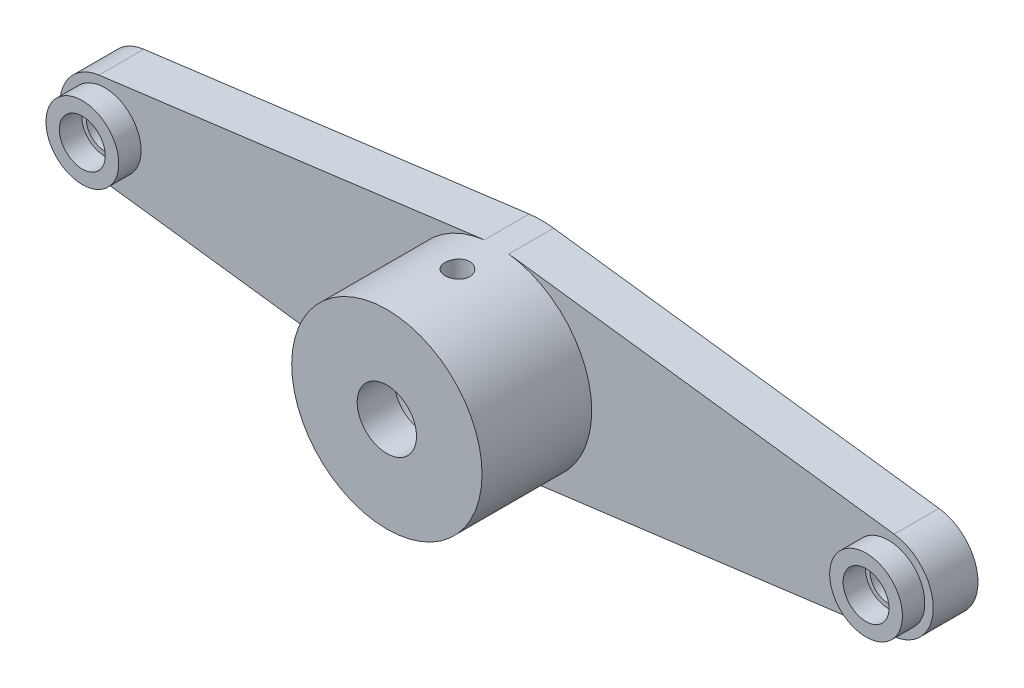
from build123d import *

# Parameters (mm, degrees)
SKETCH_1_R          = 5.25
SKETCH_1_R_2        = 1
EXTRUDE_1_DEPTH     = 4
HOLE_WIZARD_M4_1_D  = 3.3
SKETCH_6_R          = 8.5
SKETCH_6_R_2        = 5.25
EXTRUDE_2_DEPTH     = 9.8
EXTRUDE_START       = -3.3
SKETCH_7_R          = 5.25
SKETCH_7_R_2        = 2.65
EXTRUDE_3_DEPTH     = 3.3
SKETCH_8_R          = 1.1
CUT_EXTRUDE_1_DEPTH = 16.65
SKETCH_9_R          = 3.25
SKETCH_9_R_2        = 2.05
EXTRUDE_4_DEPTH     = 2


with BuildPart() as part:
    # Sketch 1 → Extrude 1 (new body)
    with BuildSketch(Plane.XY):
        with BuildLine():
            Line((-35.514285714, 3.966801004), (-1.092857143, 8.429452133))
            ThreePointArc((-1.092857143, 8.429452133), (0, 8.5), (1.092857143, 8.429452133))
            Line((1.092857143, 8.429452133), (35.514285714, 3.966801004))
            ThreePointArc((35.514285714, 3.966801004), (39, 0), (35.514285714, -3.966801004))
            Line((35.514285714, -3.966801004), (1.092857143, -8.429452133))
            ThreePointArc((1.092857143, -8.429452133), (0, -8.5), (-1.092857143, -8.429452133))
            Line((-1.092857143, -8.429452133), (-35.514285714, -3.966801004))
            ThreePointArc((-35.514285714, -3.966801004), (-39, 0), (-35.514285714, 3.966801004))
        make_face()
        Circle(SKETCH_1_R, mode=Mode.SUBTRACT)
        with Locations((-35, 0)):
            Circle(SKETCH_1_R_2, mode=Mode.SUBTRACT)
        with Locations(Location((35, 0, 0), (0, 0, 180))):
            Circle(SKETCH_1_R_2, mode=Mode.SUBTRACT)
    extrude(amount=EXTRUDE_1_DEPTH)

    # Hole Wizard M4 _1 (through all)
    with Locations(Plane(origin=(-35, 0, 4), x_dir=(1, 0, 0), z_dir=(0, 0, 1))):
        with Locations((0, 0), (70, 0)):
            Hole(HOLE_WIZARD_M4_1_D / 2)

    # Sketch 6 → Extrude 2 (add)
    with BuildSketch(Plane.XY.offset(4)):
        with Locations(Location((0, 0, 0), (0, 0, 262.612951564))):
            Circle(SKETCH_6_R)
        Circle(SKETCH_6_R_2, mode=Mode.SUBTRACT)
    extrude(amount=EXTRUDE_2_DEPTH)

    # Sketch 7 → Extrude 3 (add)
    with BuildSketch(Plane.XY.offset(13.8).offset(EXTRUDE_START)):
        Circle(SKETCH_7_R)
        Circle(SKETCH_7_R_2, mode=Mode.SUBTRACT)
    extrude(amount=EXTRUDE_3_DEPTH)

    # Sketch 8 → Cut-Extrude 1 (cut, symmetric)
    with BuildSketch(Plane(origin=(0, 0, 0), x_dir=(1, 0, 0), z_dir=(0, 1, 0))):
        with Locations(Location((0, -7.5, 0), (0, 0, 270))):
            Circle(SKETCH_8_R)
    extrude(amount=CUT_EXTRUDE_1_DEPTH, both=True, mode=Mode.SUBTRACT)

    # Sketch 9 → Extrude 4 (add)
    # profile 1 of 2: a face of its own
    with BuildSketch(Plane.XY.offset(4)):
        with Locations((-35, 0)):
            Circle(SKETCH_9_R)
        with Locations((-35, 0)):
            Circle(SKETCH_9_R_2, mode=Mode.SUBTRACT)
    # profile 2 of 2: a face of its own
    with BuildSketch(Plane.XY.offset(4)):
        with Locations(Location((35, 0, 0), (0, 0, 180))):
            Circle(SKETCH_9_R)
        with Locations(Location((35, 0, 0), (0, 0, 180))):
            Circle(SKETCH_9_R_2, mode=Mode.SUBTRACT)
    extrude(amount=EXTRUDE_4_DEPTH)


solid = part.part
